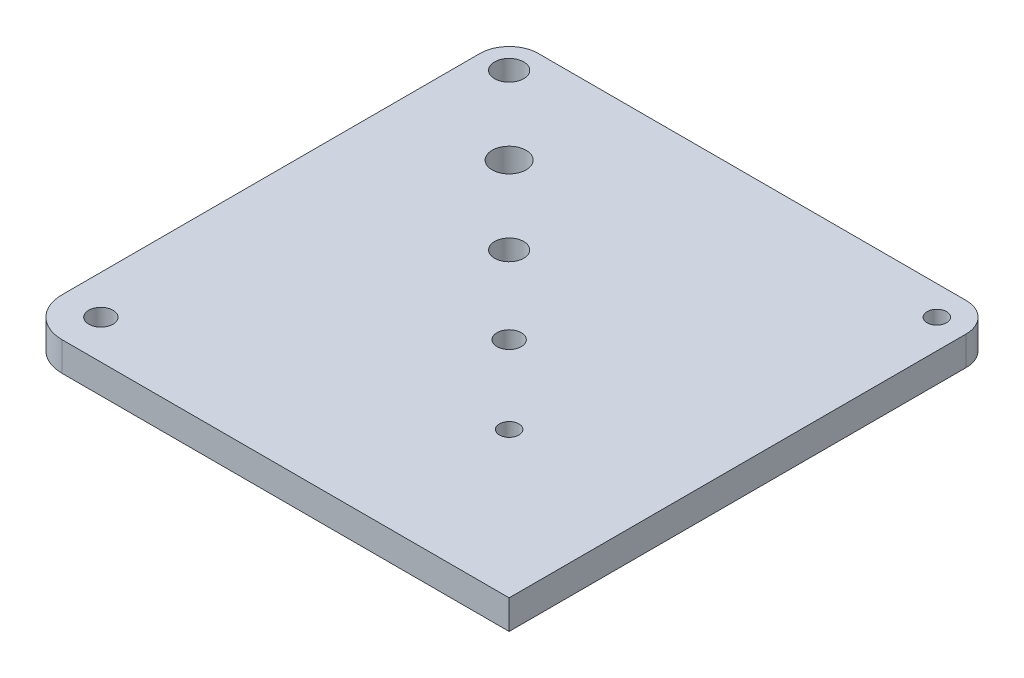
ISO-10303-21;
HEADER;
FILE_DESCRIPTION(('STEP AP214'),'2;1');
FILE_NAME('part.step','',(''),(''),'','','');
FILE_SCHEMA(('AUTOMOTIVE_DESIGN { 1 0 10303 214 1 1 1 1 }'));
ENDSEC;
DATA;
#1=APPLICATION_CONTEXT('core data for automotive mechanical design processes');
#2=APPLICATION_PROTOCOL_DEFINITION('international standard','automotive_design',2000,#1);
#3=PRODUCT_CONTEXT('',#1,'mechanical');
#4=PRODUCT('Part','Part','',(#3));
#5=PRODUCT_RELATED_PRODUCT_CATEGORY('part','',(#4));
#6=PRODUCT_DEFINITION_FORMATION('','',#4);
#7=PRODUCT_DEFINITION_CONTEXT('part definition',#1,'design');
#8=PRODUCT_DEFINITION('design','',#6,#7);
#9=PRODUCT_DEFINITION_SHAPE('','',#8);
#10=(LENGTH_UNIT() NAMED_UNIT(*) SI_UNIT(.MILLI.,.METRE.));
#11=(NAMED_UNIT(*) PLANE_ANGLE_UNIT() SI_UNIT($,.RADIAN.));
#12=(NAMED_UNIT(*) SI_UNIT($,.STERADIAN.) SOLID_ANGLE_UNIT());
#13=UNCERTAINTY_MEASURE_WITH_UNIT(LENGTH_MEASURE(1.E-05),#10,'distance_accuracy_value','');
#14=(GEOMETRIC_REPRESENTATION_CONTEXT(3) GLOBAL_UNCERTAINTY_ASSIGNED_CONTEXT((#13)) GLOBAL_UNIT_ASSIGNED_CONTEXT((#10,
#11,#12)) REPRESENTATION_CONTEXT('',''));
#15=CARTESIAN_POINT('',(0.,0.,0.));
#16=DIRECTION('',(0.,0.,1.));
#17=DIRECTION('',(1.,0.,0.));
#18=AXIS2_PLACEMENT_3D('',#15,#16,#17);
#19=CARTESIAN_POINT('',(22.,3.,-22.));
#20=DIRECTION('',(0.,-1.,0.));
#21=DIRECTION('',(0.,0.,-1.));
#22=AXIS2_PLACEMENT_3D('',#19,#20,#21);
#23=PLANE('',#22);
#24=DIRECTION('',(0.,0.,-1.));
#25=VECTOR('',#24,1.);
#26=CARTESIAN_POINT('',(25.,3.,25.));
#27=LINE('',#26,#25);
#28=CARTESIAN_POINT('',(25.,3.,25.));
#29=VERTEX_POINT('',#28);
#30=CARTESIAN_POINT('',(25.,3.,-22.));
#31=VERTEX_POINT('',#30);
#32=EDGE_CURVE('E159',#29,#31,#27,.T.);
#33=ORIENTED_EDGE('',*,*,#32,.T.);
#34=CARTESIAN_POINT('',(22.,3.,-22.));
#35=DIRECTION('',(0.,1.,0.));
#36=DIRECTION('',(0.,0.,-1.));
#37=AXIS2_PLACEMENT_3D('',#34,#35,#36);
#38=CIRCLE('',#37,3.);
#39=CARTESIAN_POINT('',(22.,3.,-25.));
#40=VERTEX_POINT('',#39);
#41=EDGE_CURVE('E101',#31,#40,#38,.T.);
#42=ORIENTED_EDGE('',*,*,#41,.T.);
#43=DIRECTION('',(-1.,0.,0.));
#44=VECTOR('',#43,1.);
#45=CARTESIAN_POINT('',(-22.,3.,-25.));
#46=LINE('',#45,#44);
#47=CARTESIAN_POINT('',(-22.,3.,-25.));
#48=VERTEX_POINT('',#47);
#49=EDGE_CURVE('E176',#40,#48,#46,.T.);
#50=ORIENTED_EDGE('',*,*,#49,.T.);
#51=CARTESIAN_POINT('',(-22.,3.,-22.));
#52=DIRECTION('',(0.,1.,0.));
#53=DIRECTION('',(0.,0.,-1.));
#54=AXIS2_PLACEMENT_3D('',#51,#52,#53);
#55=CIRCLE('',#54,3.);
#56=CARTESIAN_POINT('',(-25.,3.,-22.));
#57=VERTEX_POINT('',#56);
#58=EDGE_CURVE('E117',#48,#57,#55,.T.);
#59=ORIENTED_EDGE('',*,*,#58,.T.);
#60=DIRECTION('',(0.,0.,1.));
#61=VECTOR('',#60,1.);
#62=CARTESIAN_POINT('',(-25.,3.,21.));
#63=LINE('',#62,#61);
#64=CARTESIAN_POINT('',(-25.,3.,21.));
#65=VERTEX_POINT('',#64);
#66=EDGE_CURVE('E111',#57,#65,#63,.T.);
#67=ORIENTED_EDGE('',*,*,#66,.T.);
#68=CARTESIAN_POINT('',(-21.,3.,21.));
#69=DIRECTION('',(0.,1.,0.));
#70=DIRECTION('',(0.,0.,-1.));
#71=AXIS2_PLACEMENT_3D('',#68,#69,#70);
#72=CIRCLE('',#71,4.);
#73=CARTESIAN_POINT('',(-21.,3.,25.));
#74=VERTEX_POINT('',#73);
#75=EDGE_CURVE('E115',#65,#74,#72,.T.);
#76=ORIENTED_EDGE('',*,*,#75,.T.);
#77=DIRECTION('',(1.,0.,0.));
#78=VECTOR('',#77,1.);
#79=CARTESIAN_POINT('',(-21.,3.,25.));
#80=LINE('',#79,#78);
#81=EDGE_CURVE('E61',#74,#29,#80,.T.);
#82=ORIENTED_EDGE('',*,*,#81,.T.);
#83=EDGE_LOOP('',(#33,#42,#50,#59,#67,#76,#82));
#84=FACE_BOUND('',#83,.T.);
#85=CARTESIAN_POINT('',(-22.,3.,-22.));
#86=DIRECTION('',(0.,1.,0.));
#87=DIRECTION('',(0.,0.,1.));
#88=AXIS2_PLACEMENT_3D('',#85,#86,#87);
#89=CIRCLE('',#88,1.5);
#90=CARTESIAN_POINT('',(-22.,3.,-20.5));
#91=VERTEX_POINT('',#90);
#92=EDGE_CURVE('E144',#91,#91,#89,.T.);
#93=ORIENTED_EDGE('',*,*,#92,.F.);
#94=EDGE_LOOP('',(#93));
#95=FACE_BOUND('',#94,.T.);
#96=CARTESIAN_POINT('',(22.,3.,-22.));
#97=DIRECTION('',(0.,1.,0.));
#98=DIRECTION('',(0.,0.,1.));
#99=AXIS2_PLACEMENT_3D('',#96,#97,#98);
#100=CIRCLE('',#99,1.);
#101=CARTESIAN_POINT('',(22.,3.,-21.));
#102=VERTEX_POINT('',#101);
#103=EDGE_CURVE('E196',#102,#102,#100,.T.);
#104=ORIENTED_EDGE('',*,*,#103,.F.);
#105=EDGE_LOOP('',(#104));
#106=FACE_BOUND('',#105,.T.);
#107=CARTESIAN_POINT('',(-21.,3.,21.));
#108=DIRECTION('',(0.,1.,0.));
#109=DIRECTION('',(0.,0.,1.));
#110=AXIS2_PLACEMENT_3D('',#107,#108,#109);
#111=CIRCLE('',#110,1.25);
#112=CARTESIAN_POINT('',(-21.,3.,22.25));
#113=VERTEX_POINT('',#112);
#114=EDGE_CURVE('E204',#113,#113,#111,.T.);
#115=ORIENTED_EDGE('',*,*,#114,.F.);
#116=EDGE_LOOP('',(#115));
#117=FACE_BOUND('',#116,.T.);
#118=CARTESIAN_POINT('',(-14.,3.,-14.));
#119=DIRECTION('',(0.,1.,0.));
#120=DIRECTION('',(0.,0.,1.));
#121=AXIS2_PLACEMENT_3D('',#118,#119,#120);
#122=CIRCLE('',#121,1.75);
#123=CARTESIAN_POINT('',(-14.,3.,-12.25));
#124=VERTEX_POINT('',#123);
#125=EDGE_CURVE('E212',#124,#124,#122,.T.);
#126=ORIENTED_EDGE('',*,*,#125,.F.);
#127=EDGE_LOOP('',(#126));
#128=FACE_BOUND('',#127,.T.);
#129=CARTESIAN_POINT('',(-6.,3.,-6.));
#130=DIRECTION('',(0.,1.,0.));
#131=DIRECTION('',(0.,0.,1.));
#132=AXIS2_PLACEMENT_3D('',#129,#130,#131);
#133=CIRCLE('',#132,1.5);
#134=CARTESIAN_POINT('',(-6.,3.,-4.5));
#135=VERTEX_POINT('',#134);
#136=EDGE_CURVE('E220',#135,#135,#133,.T.);
#137=ORIENTED_EDGE('',*,*,#136,.F.);
#138=EDGE_LOOP('',(#137));
#139=FACE_BOUND('',#138,.T.);
#140=CARTESIAN_POINT('',(2.,3.,2.));
#141=DIRECTION('',(0.,1.,0.));
#142=DIRECTION('',(0.,0.,1.));
#143=AXIS2_PLACEMENT_3D('',#140,#141,#142);
#144=CIRCLE('',#143,1.25);
#145=CARTESIAN_POINT('',(2.,3.,3.25));
#146=VERTEX_POINT('',#145);
#147=EDGE_CURVE('E228',#146,#146,#144,.T.);
#148=ORIENTED_EDGE('',*,*,#147,.F.);
#149=EDGE_LOOP('',(#148));
#150=FACE_BOUND('',#149,.T.);
#151=CARTESIAN_POINT('',(10.,3.,10.));
#152=DIRECTION('',(0.,1.,0.));
#153=DIRECTION('',(0.,0.,1.));
#154=AXIS2_PLACEMENT_3D('',#151,#152,#153);
#155=CIRCLE('',#154,0.999999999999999);
#156=CARTESIAN_POINT('',(10.,3.,11.));
#157=VERTEX_POINT('',#156);
#158=EDGE_CURVE('E236',#157,#157,#155,.T.);
#159=ORIENTED_EDGE('',*,*,#158,.F.);
#160=EDGE_LOOP('',(#159));
#161=FACE_BOUND('',#160,.T.);
#162=ADVANCED_FACE('F43',(#84,#95,#106,#117,#128,#139,#150,#161),#23,.F.);
#163=CARTESIAN_POINT('',(22.,0.,-22.));
#164=DIRECTION('',(0.,-1.,0.));
#165=DIRECTION('',(0.,0.,-1.));
#166=AXIS2_PLACEMENT_3D('',#163,#164,#165);
#167=PLANE('',#166);
#168=CARTESIAN_POINT('',(2.,0.,2.));
#169=DIRECTION('',(0.,1.,0.));
#170=DIRECTION('',(0.,0.,1.));
#171=AXIS2_PLACEMENT_3D('',#168,#169,#170);
#172=CIRCLE('',#171,1.25);
#173=CARTESIAN_POINT('',(2.,0.,3.25));
#174=VERTEX_POINT('',#173);
#175=EDGE_CURVE('E232',#174,#174,#172,.T.);
#176=ORIENTED_EDGE('',*,*,#175,.T.);
#177=EDGE_LOOP('',(#176));
#178=FACE_BOUND('',#177,.T.);
#179=CARTESIAN_POINT('',(-14.,0.,-14.));
#180=DIRECTION('',(0.,1.,0.));
#181=DIRECTION('',(0.,0.,1.));
#182=AXIS2_PLACEMENT_3D('',#179,#180,#181);
#183=CIRCLE('',#182,1.75);
#184=CARTESIAN_POINT('',(-14.,0.,-12.25));
#185=VERTEX_POINT('',#184);
#186=EDGE_CURVE('E216',#185,#185,#183,.T.);
#187=ORIENTED_EDGE('',*,*,#186,.T.);
#188=EDGE_LOOP('',(#187));
#189=FACE_BOUND('',#188,.T.);
#190=CARTESIAN_POINT('',(22.,0.,-22.));
#191=DIRECTION('',(0.,1.,0.));
#192=DIRECTION('',(0.,0.,1.));
#193=AXIS2_PLACEMENT_3D('',#190,#191,#192);
#194=CIRCLE('',#193,1.);
#195=CARTESIAN_POINT('',(22.,0.,-21.));
#196=VERTEX_POINT('',#195);
#197=EDGE_CURVE('E200',#196,#196,#194,.T.);
#198=ORIENTED_EDGE('',*,*,#197,.T.);
#199=EDGE_LOOP('',(#198));
#200=FACE_BOUND('',#199,.T.);
#201=DIRECTION('',(0.,0.,-1.));
#202=VECTOR('',#201,1.);
#203=CARTESIAN_POINT('',(25.,0.,25.));
#204=LINE('',#203,#202);
#205=CARTESIAN_POINT('',(25.,0.,25.));
#206=VERTEX_POINT('',#205);
#207=CARTESIAN_POINT('',(25.,0.,-22.));
#208=VERTEX_POINT('',#207);
#209=EDGE_CURVE('E139',#206,#208,#204,.T.);
#210=ORIENTED_EDGE('',*,*,#209,.F.);
#211=DIRECTION('',(1.,0.,0.));
#212=VECTOR('',#211,1.);
#213=CARTESIAN_POINT('',(-21.,0.,25.));
#214=LINE('',#213,#212);
#215=CARTESIAN_POINT('',(-21.,0.,25.));
#216=VERTEX_POINT('',#215);
#217=EDGE_CURVE('E93',#216,#206,#214,.T.);
#218=ORIENTED_EDGE('',*,*,#217,.F.);
#219=CARTESIAN_POINT('',(-21.,0.,21.));
#220=DIRECTION('',(0.,1.,0.));
#221=DIRECTION('',(0.,0.,-1.));
#222=AXIS2_PLACEMENT_3D('',#219,#220,#221);
#223=CIRCLE('',#222,4.);
#224=CARTESIAN_POINT('',(-25.,0.,21.));
#225=VERTEX_POINT('',#224);
#226=EDGE_CURVE('E87',#225,#216,#223,.T.);
#227=ORIENTED_EDGE('',*,*,#226,.F.);
#228=DIRECTION('',(0.,0.,1.));
#229=VECTOR('',#228,1.);
#230=CARTESIAN_POINT('',(-25.,0.,21.));
#231=LINE('',#230,#229);
#232=CARTESIAN_POINT('',(-25.,0.,-22.));
#233=VERTEX_POINT('',#232);
#234=EDGE_CURVE('E126',#233,#225,#231,.T.);
#235=ORIENTED_EDGE('',*,*,#234,.F.);
#236=CARTESIAN_POINT('',(-22.,0.,-22.));
#237=DIRECTION('',(0.,1.,0.));
#238=DIRECTION('',(0.,0.,-1.));
#239=AXIS2_PLACEMENT_3D('',#236,#237,#238);
#240=CIRCLE('',#239,3.);
#241=CARTESIAN_POINT('',(-22.,0.,-25.));
#242=VERTEX_POINT('',#241);
#243=EDGE_CURVE('E150',#242,#233,#240,.T.);
#244=ORIENTED_EDGE('',*,*,#243,.F.);
#245=DIRECTION('',(-1.,0.,0.));
#246=VECTOR('',#245,1.);
#247=CARTESIAN_POINT('',(-22.,0.,-25.));
#248=LINE('',#247,#246);
#249=CARTESIAN_POINT('',(22.,0.,-25.));
#250=VERTEX_POINT('',#249);
#251=EDGE_CURVE('E147',#250,#242,#248,.T.);
#252=ORIENTED_EDGE('',*,*,#251,.F.);
#253=CARTESIAN_POINT('',(22.,0.,-22.));
#254=DIRECTION('',(0.,1.,0.));
#255=DIRECTION('',(0.,0.,-1.));
#256=AXIS2_PLACEMENT_3D('',#253,#254,#255);
#257=CIRCLE('',#256,3.);
#258=EDGE_CURVE('E143',#208,#250,#257,.T.);
#259=ORIENTED_EDGE('',*,*,#258,.F.);
#260=EDGE_LOOP('',(#210,#218,#227,#235,#244,#252,#259));
#261=FACE_BOUND('',#260,.T.);
#262=CARTESIAN_POINT('',(-22.,0.,-22.));
#263=DIRECTION('',(0.,1.,0.));
#264=DIRECTION('',(0.,0.,1.));
#265=AXIS2_PLACEMENT_3D('',#262,#263,#264);
#266=CIRCLE('',#265,1.5);
#267=CARTESIAN_POINT('',(-22.,0.,-20.5));
#268=VERTEX_POINT('',#267);
#269=EDGE_CURVE('E192',#268,#268,#266,.T.);
#270=ORIENTED_EDGE('',*,*,#269,.T.);
#271=EDGE_LOOP('',(#270));
#272=FACE_BOUND('',#271,.T.);
#273=CARTESIAN_POINT('',(-21.,0.,21.));
#274=DIRECTION('',(0.,1.,0.));
#275=DIRECTION('',(0.,0.,1.));
#276=AXIS2_PLACEMENT_3D('',#273,#274,#275);
#277=CIRCLE('',#276,1.25);
#278=CARTESIAN_POINT('',(-21.,0.,22.25));
#279=VERTEX_POINT('',#278);
#280=EDGE_CURVE('E208',#279,#279,#277,.T.);
#281=ORIENTED_EDGE('',*,*,#280,.T.);
#282=EDGE_LOOP('',(#281));
#283=FACE_BOUND('',#282,.T.);
#284=CARTESIAN_POINT('',(-6.,0.,-6.));
#285=DIRECTION('',(0.,1.,0.));
#286=DIRECTION('',(0.,0.,1.));
#287=AXIS2_PLACEMENT_3D('',#284,#285,#286);
#288=CIRCLE('',#287,1.5);
#289=CARTESIAN_POINT('',(-6.,0.,-4.5));
#290=VERTEX_POINT('',#289);
#291=EDGE_CURVE('E224',#290,#290,#288,.T.);
#292=ORIENTED_EDGE('',*,*,#291,.T.);
#293=EDGE_LOOP('',(#292));
#294=FACE_BOUND('',#293,.T.);
#295=CARTESIAN_POINT('',(10.,0.,10.));
#296=DIRECTION('',(0.,1.,0.));
#297=DIRECTION('',(0.,0.,1.));
#298=AXIS2_PLACEMENT_3D('',#295,#296,#297);
#299=CIRCLE('',#298,0.999999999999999);
#300=CARTESIAN_POINT('',(10.,0.,11.));
#301=VERTEX_POINT('',#300);
#302=EDGE_CURVE('E240',#301,#301,#299,.T.);
#303=ORIENTED_EDGE('',*,*,#302,.T.);
#304=EDGE_LOOP('',(#303));
#305=FACE_BOUND('',#304,.T.);
#306=ADVANCED_FACE('F180',(#178,#189,#200,#261,#272,#283,#294,#305),#167,.T.);
#307=CARTESIAN_POINT('',(25.,3.,25.));
#308=DIRECTION('',(-1.,0.,0.));
#309=DIRECTION('',(0.,0.,1.));
#310=AXIS2_PLACEMENT_3D('',#307,#308,#309);
#311=PLANE('',#310);
#312=ORIENTED_EDGE('',*,*,#209,.T.);
#313=DIRECTION('',(0.,-1.,0.));
#314=VECTOR('',#313,1.);
#315=CARTESIAN_POINT('',(25.,3.,-22.));
#316=LINE('',#315,#314);
#317=EDGE_CURVE('E11',#31,#208,#316,.T.);
#318=ORIENTED_EDGE('',*,*,#317,.F.);
#319=ORIENTED_EDGE('',*,*,#32,.F.);
#320=DIRECTION('',(0.,-1.,0.));
#321=VECTOR('',#320,1.);
#322=CARTESIAN_POINT('',(25.,3.,25.));
#323=LINE('',#322,#321);
#324=EDGE_CURVE('E135',#29,#206,#323,.T.);
#325=ORIENTED_EDGE('',*,*,#324,.T.);
#326=EDGE_LOOP('',(#312,#318,#319,#325));
#327=FACE_BOUND('',#326,.T.);
#328=ADVANCED_FACE('F45',(#327),#311,.F.);
#329=CARTESIAN_POINT('',(22.,3.,-22.));
#330=DIRECTION('',(0.,-1.,0.));
#331=DIRECTION('',(0.,0.,-1.));
#332=AXIS2_PLACEMENT_3D('',#329,#330,#331);
#333=CYLINDRICAL_SURFACE('',#332,3.);
#334=ORIENTED_EDGE('',*,*,#258,.T.);
#335=DIRECTION('',(0.,-1.,0.));
#336=VECTOR('',#335,1.);
#337=CARTESIAN_POINT('',(22.,3.,-25.));
#338=LINE('',#337,#336);
#339=EDGE_CURVE('E53',#40,#250,#338,.T.);
#340=ORIENTED_EDGE('',*,*,#339,.F.);
#341=ORIENTED_EDGE('',*,*,#41,.F.);
#342=ORIENTED_EDGE('',*,*,#317,.T.);
#343=EDGE_LOOP('',(#334,#340,#341,#342));
#344=FACE_BOUND('',#343,.T.);
#345=ADVANCED_FACE('F272',(#344),#333,.T.);
#346=CARTESIAN_POINT('',(-22.,3.,-25.));
#347=DIRECTION('',(0.,0.,1.));
#348=DIRECTION('',(1.,0.,0.));
#349=AXIS2_PLACEMENT_3D('',#346,#347,#348);
#350=PLANE('',#349);
#351=ORIENTED_EDGE('',*,*,#251,.T.);
#352=DIRECTION('',(0.,-1.,0.));
#353=VECTOR('',#352,1.);
#354=CARTESIAN_POINT('',(-22.,3.,-25.));
#355=LINE('',#354,#353);
#356=EDGE_CURVE('E166',#48,#242,#355,.T.);
#357=ORIENTED_EDGE('',*,*,#356,.F.);
#358=ORIENTED_EDGE('',*,*,#49,.F.);
#359=ORIENTED_EDGE('',*,*,#339,.T.);
#360=EDGE_LOOP('',(#351,#357,#358,#359));
#361=FACE_BOUND('',#360,.T.);
#362=ADVANCED_FACE('F174',(#361),#350,.F.);
#363=CARTESIAN_POINT('',(-22.,3.,-22.));
#364=DIRECTION('',(0.,-1.,0.));
#365=DIRECTION('',(0.,0.,-1.));
#366=AXIS2_PLACEMENT_3D('',#363,#364,#365);
#367=CYLINDRICAL_SURFACE('',#366,3.);
#368=ORIENTED_EDGE('',*,*,#243,.T.);
#369=DIRECTION('',(0.,-1.,0.));
#370=VECTOR('',#369,1.);
#371=CARTESIAN_POINT('',(-25.,3.,-22.));
#372=LINE('',#371,#370);
#373=EDGE_CURVE('E128',#57,#233,#372,.T.);
#374=ORIENTED_EDGE('',*,*,#373,.F.);
#375=ORIENTED_EDGE('',*,*,#58,.F.);
#376=ORIENTED_EDGE('',*,*,#356,.T.);
#377=EDGE_LOOP('',(#368,#374,#375,#376));
#378=FACE_BOUND('',#377,.T.);
#379=ADVANCED_FACE('F183',(#378),#367,.T.);
#380=CARTESIAN_POINT('',(-25.,3.,21.));
#381=DIRECTION('',(1.,0.,0.));
#382=DIRECTION('',(0.,0.,-1.));
#383=AXIS2_PLACEMENT_3D('',#380,#381,#382);
#384=PLANE('',#383);
#385=ORIENTED_EDGE('',*,*,#234,.T.);
#386=DIRECTION('',(0.,-1.,0.));
#387=VECTOR('',#386,1.);
#388=CARTESIAN_POINT('',(-25.,3.,21.));
#389=LINE('',#388,#387);
#390=EDGE_CURVE('E123',#65,#225,#389,.T.);
#391=ORIENTED_EDGE('',*,*,#390,.F.);
#392=ORIENTED_EDGE('',*,*,#66,.F.);
#393=ORIENTED_EDGE('',*,*,#373,.T.);
#394=EDGE_LOOP('',(#385,#391,#392,#393));
#395=FACE_BOUND('',#394,.T.);
#396=ADVANCED_FACE('F124',(#395),#384,.F.);
#397=CARTESIAN_POINT('',(-21.,3.,21.));
#398=DIRECTION('',(0.,-1.,0.));
#399=DIRECTION('',(0.,0.,-1.));
#400=AXIS2_PLACEMENT_3D('',#397,#398,#399);
#401=CYLINDRICAL_SURFACE('',#400,4.);
#402=ORIENTED_EDGE('',*,*,#226,.T.);
#403=DIRECTION('',(0.,-1.,0.));
#404=VECTOR('',#403,1.);
#405=CARTESIAN_POINT('',(-21.,3.,25.));
#406=LINE('',#405,#404);
#407=EDGE_CURVE('E129',#74,#216,#406,.T.);
#408=ORIENTED_EDGE('',*,*,#407,.F.);
#409=ORIENTED_EDGE('',*,*,#75,.F.);
#410=ORIENTED_EDGE('',*,*,#390,.T.);
#411=EDGE_LOOP('',(#402,#408,#409,#410));
#412=FACE_BOUND('',#411,.T.);
#413=ADVANCED_FACE('F131',(#412),#401,.T.);
#414=CARTESIAN_POINT('',(-21.,3.,25.));
#415=DIRECTION('',(0.,0.,-1.));
#416=DIRECTION('',(-1.,0.,0.));
#417=AXIS2_PLACEMENT_3D('',#414,#415,#416);
#418=PLANE('',#417);
#419=ORIENTED_EDGE('',*,*,#217,.T.);
#420=ORIENTED_EDGE('',*,*,#324,.F.);
#421=ORIENTED_EDGE('',*,*,#81,.F.);
#422=ORIENTED_EDGE('',*,*,#407,.T.);
#423=EDGE_LOOP('',(#419,#420,#421,#422));
#424=FACE_BOUND('',#423,.T.);
#425=ADVANCED_FACE('F262',(#424),#418,.F.);
#426=CARTESIAN_POINT('',(-22.,3.,-22.));
#427=DIRECTION('',(0.,-1.,0.));
#428=DIRECTION('',(0.,0.,-1.));
#429=AXIS2_PLACEMENT_3D('',#426,#427,#428);
#430=CYLINDRICAL_SURFACE('',#429,1.5);
#431=ORIENTED_EDGE('',*,*,#92,.T.);
#432=EDGE_LOOP('',(#431));
#433=FACE_BOUND('',#432,.T.);
#434=ORIENTED_EDGE('',*,*,#269,.F.);
#435=EDGE_LOOP('',(#434));
#436=FACE_BOUND('',#435,.T.);
#437=ADVANCED_FACE('F259',(#433,#436),#430,.F.);
#438=CARTESIAN_POINT('',(22.,3.,-22.));
#439=DIRECTION('',(0.,-1.,0.));
#440=DIRECTION('',(0.,0.,-1.));
#441=AXIS2_PLACEMENT_3D('',#438,#439,#440);
#442=CYLINDRICAL_SURFACE('',#441,1.);
#443=ORIENTED_EDGE('',*,*,#103,.T.);
#444=EDGE_LOOP('',(#443));
#445=FACE_BOUND('',#444,.T.);
#446=ORIENTED_EDGE('',*,*,#197,.F.);
#447=EDGE_LOOP('',(#446));
#448=FACE_BOUND('',#447,.T.);
#449=ADVANCED_FACE('F342',(#445,#448),#442,.F.);
#450=CARTESIAN_POINT('',(-21.,3.,21.));
#451=DIRECTION('',(0.,-1.,0.));
#452=DIRECTION('',(0.,0.,-1.));
#453=AXIS2_PLACEMENT_3D('',#450,#451,#452);
#454=CYLINDRICAL_SURFACE('',#453,1.25);
#455=ORIENTED_EDGE('',*,*,#114,.T.);
#456=EDGE_LOOP('',(#455));
#457=FACE_BOUND('',#456,.T.);
#458=ORIENTED_EDGE('',*,*,#280,.F.);
#459=EDGE_LOOP('',(#458));
#460=FACE_BOUND('',#459,.T.);
#461=ADVANCED_FACE('F351',(#457,#460),#454,.F.);
#462=CARTESIAN_POINT('',(-14.,3.,-14.));
#463=DIRECTION('',(0.,-1.,0.));
#464=DIRECTION('',(0.,0.,-1.));
#465=AXIS2_PLACEMENT_3D('',#462,#463,#464);
#466=CYLINDRICAL_SURFACE('',#465,1.75);
#467=ORIENTED_EDGE('',*,*,#125,.T.);
#468=EDGE_LOOP('',(#467));
#469=FACE_BOUND('',#468,.T.);
#470=ORIENTED_EDGE('',*,*,#186,.F.);
#471=EDGE_LOOP('',(#470));
#472=FACE_BOUND('',#471,.T.);
#473=ADVANCED_FACE('F360',(#469,#472),#466,.F.);
#474=CARTESIAN_POINT('',(-6.,3.,-6.));
#475=DIRECTION('',(0.,-1.,0.));
#476=DIRECTION('',(0.,0.,-1.));
#477=AXIS2_PLACEMENT_3D('',#474,#475,#476);
#478=CYLINDRICAL_SURFACE('',#477,1.5);
#479=ORIENTED_EDGE('',*,*,#136,.T.);
#480=EDGE_LOOP('',(#479));
#481=FACE_BOUND('',#480,.T.);
#482=ORIENTED_EDGE('',*,*,#291,.F.);
#483=EDGE_LOOP('',(#482));
#484=FACE_BOUND('',#483,.T.);
#485=ADVANCED_FACE('F370',(#481,#484),#478,.F.);
#486=CARTESIAN_POINT('',(2.,3.,2.));
#487=DIRECTION('',(0.,-1.,0.));
#488=DIRECTION('',(0.,0.,-1.));
#489=AXIS2_PLACEMENT_3D('',#486,#487,#488);
#490=CYLINDRICAL_SURFACE('',#489,1.25);
#491=ORIENTED_EDGE('',*,*,#147,.T.);
#492=EDGE_LOOP('',(#491));
#493=FACE_BOUND('',#492,.T.);
#494=ORIENTED_EDGE('',*,*,#175,.F.);
#495=EDGE_LOOP('',(#494));
#496=FACE_BOUND('',#495,.T.);
#497=ADVANCED_FACE('F380',(#493,#496),#490,.F.);
#498=CARTESIAN_POINT('',(10.,3.,10.));
#499=DIRECTION('',(0.,-1.,0.));
#500=DIRECTION('',(0.,0.,-1.));
#501=AXIS2_PLACEMENT_3D('',#498,#499,#500);
#502=CYLINDRICAL_SURFACE('',#501,0.999999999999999);
#503=ORIENTED_EDGE('',*,*,#158,.T.);
#504=EDGE_LOOP('',(#503));
#505=FACE_BOUND('',#504,.T.);
#506=ORIENTED_EDGE('',*,*,#302,.F.);
#507=EDGE_LOOP('',(#506));
#508=FACE_BOUND('',#507,.T.);
#509=ADVANCED_FACE('F248',(#505,#508),#502,.F.);
#510=CLOSED_SHELL('',(#162,#306,#328,#345,#362,#379,#396,#413,#425,#437,#449,#461,#473,#485,
#497,#509));
#511=MANIFOLD_SOLID_BREP('B2',#510);
#512=ADVANCED_BREP_SHAPE_REPRESENTATION('',(#18,#511),#14);
#513=SHAPE_DEFINITION_REPRESENTATION(#9,#512);
ENDSEC;
END-ISO-10303-21;
